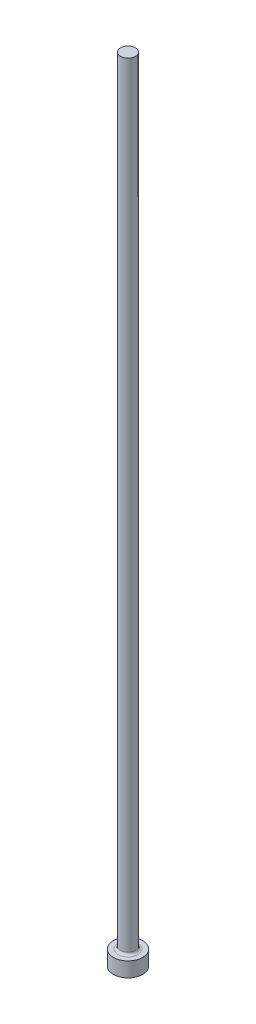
ISO-10303-21;
HEADER;
FILE_DESCRIPTION(('STEP AP214'),'2;1');
FILE_NAME('part.step','',(''),(''),'','','');
FILE_SCHEMA(('AUTOMOTIVE_DESIGN { 1 0 10303 214 1 1 1 1 }'));
ENDSEC;
DATA;
#1=APPLICATION_CONTEXT('core data for automotive mechanical design processes');
#2=APPLICATION_PROTOCOL_DEFINITION('international standard','automotive_design',2000,#1);
#3=PRODUCT_CONTEXT('',#1,'mechanical');
#4=PRODUCT('Part','Part','',(#3));
#5=PRODUCT_RELATED_PRODUCT_CATEGORY('part','',(#4));
#6=PRODUCT_DEFINITION_FORMATION('','',#4);
#7=PRODUCT_DEFINITION_CONTEXT('part definition',#1,'design');
#8=PRODUCT_DEFINITION('design','',#6,#7);
#9=PRODUCT_DEFINITION_SHAPE('','',#8);
#10=(LENGTH_UNIT() NAMED_UNIT(*) SI_UNIT(.MILLI.,.METRE.));
#11=(NAMED_UNIT(*) PLANE_ANGLE_UNIT() SI_UNIT($,.RADIAN.));
#12=(NAMED_UNIT(*) SI_UNIT($,.STERADIAN.) SOLID_ANGLE_UNIT());
#13=UNCERTAINTY_MEASURE_WITH_UNIT(LENGTH_MEASURE(1.E-05),#10,'distance_accuracy_value','');
#14=(GEOMETRIC_REPRESENTATION_CONTEXT(3) GLOBAL_UNCERTAINTY_ASSIGNED_CONTEXT((#13)) GLOBAL_UNIT_ASSIGNED_CONTEXT((#10,
#11,#12)) REPRESENTATION_CONTEXT('',''));
#15=CARTESIAN_POINT('',(0.,0.,0.));
#16=DIRECTION('',(0.,0.,1.));
#17=DIRECTION('',(1.,0.,0.));
#18=AXIS2_PLACEMENT_3D('',#15,#16,#17);
#19=CARTESIAN_POINT('',(2.38124999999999,254.,0.));
#20=DIRECTION('',(0.,-1.,0.));
#21=DIRECTION('',(1.,0.,0.));
#22=AXIS2_PLACEMENT_3D('',#19,#20,#21);
#23=PLANE('',#22);
#24=CARTESIAN_POINT('',(0.,254.,0.));
#25=DIRECTION('',(0.,1.,0.));
#26=DIRECTION('',(-1.,0.,0.));
#27=AXIS2_PLACEMENT_3D('',#24,#25,#26);
#28=CIRCLE('',#27,2.38125);
#29=CARTESIAN_POINT('',(-2.38125000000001,254.,0.));
#30=VERTEX_POINT('',#29);
#31=EDGE_CURVE('E10',#30,#30,#28,.T.);
#32=ORIENTED_EDGE('',*,*,#31,.T.);
#33=EDGE_LOOP('',(#32));
#34=FACE_BOUND('',#33,.T.);
#35=ADVANCED_FACE('F30',(#34),#23,.F.);
#36=CARTESIAN_POINT('',(0.,254.,0.));
#37=DIRECTION('',(0.,1.,0.));
#38=DIRECTION('',(-1.,0.,0.));
#39=AXIS2_PLACEMENT_3D('',#36,#37,#38);
#40=CYLINDRICAL_SURFACE('',#39,2.38125);
#41=ORIENTED_EDGE('',*,*,#31,.F.);
#42=EDGE_LOOP('',(#41));
#43=FACE_BOUND('',#42,.T.);
#44=CARTESIAN_POINT('',(0.,5.51180000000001,0.));
#45=DIRECTION('',(0.,1.,0.));
#46=DIRECTION('',(-1.,0.,0.));
#47=AXIS2_PLACEMENT_3D('',#44,#45,#46);
#48=CIRCLE('',#47,2.38125);
#49=CARTESIAN_POINT('',(-2.38125,5.51180000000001,0.));
#50=VERTEX_POINT('',#49);
#51=EDGE_CURVE('E36',#50,#50,#48,.T.);
#52=ORIENTED_EDGE('',*,*,#51,.T.);
#53=EDGE_LOOP('',(#52));
#54=FACE_BOUND('',#53,.T.);
#55=ADVANCED_FACE('F65',(#43,#54),#40,.T.);
#56=CARTESIAN_POINT('',(0.,5.5118,0.));
#57=DIRECTION('',(0.,1.,0.));
#58=DIRECTION('',(-1.,0.,0.));
#59=AXIS2_PLACEMENT_3D('',#56,#57,#58);
#60=TOROIDAL_SURFACE('',#59,3.14325,0.762);
#61=ORIENTED_EDGE('',*,*,#51,.F.);
#62=EDGE_LOOP('',(#61));
#63=FACE_BOUND('',#62,.T.);
#64=CARTESIAN_POINT('',(0.,4.7498,0.));
#65=DIRECTION('',(0.,1.,0.));
#66=DIRECTION('',(-1.,0.,0.));
#67=AXIS2_PLACEMENT_3D('',#64,#65,#66);
#68=CIRCLE('',#67,3.14325000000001);
#69=CARTESIAN_POINT('',(-3.14325000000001,4.7498,0.));
#70=VERTEX_POINT('',#69);
#71=EDGE_CURVE('E40',#70,#70,#68,.T.);
#72=ORIENTED_EDGE('',*,*,#71,.T.);
#73=EDGE_LOOP('',(#72));
#74=FACE_BOUND('',#73,.T.);
#75=ADVANCED_FACE('F69',(#63,#74),#60,.F.);
#76=CARTESIAN_POINT('',(4.699,4.7498,0.));
#77=DIRECTION('',(0.,-1.,0.));
#78=DIRECTION('',(1.,0.,0.));
#79=AXIS2_PLACEMENT_3D('',#76,#77,#78);
#80=PLANE('',#79);
#81=ORIENTED_EDGE('',*,*,#71,.F.);
#82=EDGE_LOOP('',(#81));
#83=FACE_BOUND('',#82,.T.);
#84=CARTESIAN_POINT('',(0.,4.7498,0.));
#85=DIRECTION('',(0.,1.,0.));
#86=DIRECTION('',(-1.,0.,0.));
#87=AXIS2_PLACEMENT_3D('',#84,#85,#86);
#88=CIRCLE('',#87,4.699);
#89=CARTESIAN_POINT('',(-4.699,4.7498,0.));
#90=VERTEX_POINT('',#89);
#91=EDGE_CURVE('E44',#90,#90,#88,.T.);
#92=ORIENTED_EDGE('',*,*,#91,.T.);
#93=EDGE_LOOP('',(#92));
#94=FACE_BOUND('',#93,.T.);
#95=ADVANCED_FACE('F61',(#83,#94),#80,.F.);
#96=CARTESIAN_POINT('',(0.,254.,0.));
#97=DIRECTION('',(0.,1.,0.));
#98=DIRECTION('',(-1.,0.,0.));
#99=AXIS2_PLACEMENT_3D('',#96,#97,#98);
#100=CYLINDRICAL_SURFACE('',#99,4.699);
#101=ORIENTED_EDGE('',*,*,#91,.F.);
#102=EDGE_LOOP('',(#101));
#103=FACE_BOUND('',#102,.T.);
#104=CARTESIAN_POINT('',(0.,0.,0.));
#105=DIRECTION('',(0.,1.,0.));
#106=DIRECTION('',(-1.,0.,0.));
#107=AXIS2_PLACEMENT_3D('',#104,#105,#106);
#108=CIRCLE('',#107,4.699);
#109=CARTESIAN_POINT('',(-4.699,0.,0.));
#110=VERTEX_POINT('',#109);
#111=EDGE_CURVE('E49',#110,#110,#108,.T.);
#112=ORIENTED_EDGE('',*,*,#111,.T.);
#113=EDGE_LOOP('',(#112));
#114=FACE_BOUND('',#113,.T.);
#115=ADVANCED_FACE('F53',(#103,#114),#100,.T.);
#116=CARTESIAN_POINT('',(0.,0.,0.));
#117=DIRECTION('',(0.,1.,0.));
#118=DIRECTION('',(-1.,0.,0.));
#119=AXIS2_PLACEMENT_3D('',#116,#117,#118);
#120=PLANE('',#119);
#121=ORIENTED_EDGE('',*,*,#111,.F.);
#122=EDGE_LOOP('',(#121));
#123=FACE_BOUND('',#122,.T.);
#124=ADVANCED_FACE('F55',(#123),#120,.F.);
#125=CLOSED_SHELL('',(#35,#55,#75,#95,#115,#124));
#126=MANIFOLD_SOLID_BREP('B2',#125);
#127=ADVANCED_BREP_SHAPE_REPRESENTATION('',(#18,#126),#14);
#128=SHAPE_DEFINITION_REPRESENTATION(#9,#127);
ENDSEC;
END-ISO-10303-21;
